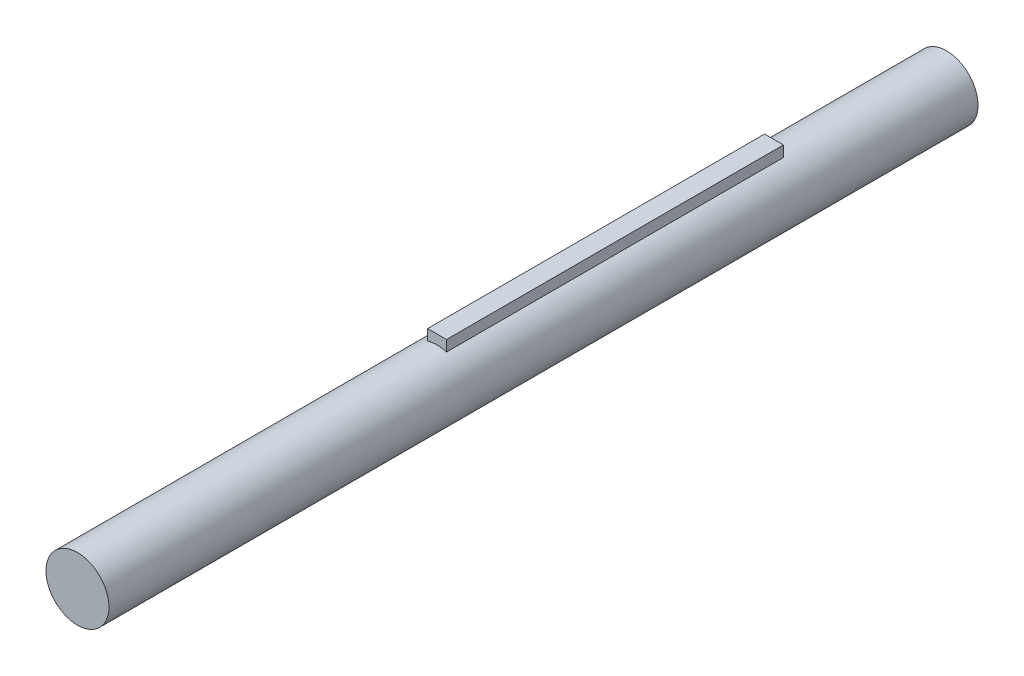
ISO-10303-21;
HEADER;
FILE_DESCRIPTION(('STEP AP214'),'2;1');
FILE_NAME('part.step','',(''),(''),'','','');
FILE_SCHEMA(('AUTOMOTIVE_DESIGN { 1 0 10303 214 1 1 1 1 }'));
ENDSEC;
DATA;
#1=APPLICATION_CONTEXT('core data for automotive mechanical design processes');
#2=APPLICATION_PROTOCOL_DEFINITION('international standard','automotive_design',2000,#1);
#3=PRODUCT_CONTEXT('',#1,'mechanical');
#4=PRODUCT('Part','Part','',(#3));
#5=PRODUCT_RELATED_PRODUCT_CATEGORY('part','',(#4));
#6=PRODUCT_DEFINITION_FORMATION('','',#4);
#7=PRODUCT_DEFINITION_CONTEXT('part definition',#1,'design');
#8=PRODUCT_DEFINITION('design','',#6,#7);
#9=PRODUCT_DEFINITION_SHAPE('','',#8);
#10=(LENGTH_UNIT() NAMED_UNIT(*) SI_UNIT(.MILLI.,.METRE.));
#11=(NAMED_UNIT(*) PLANE_ANGLE_UNIT() SI_UNIT($,.RADIAN.));
#12=(NAMED_UNIT(*) SI_UNIT($,.STERADIAN.) SOLID_ANGLE_UNIT());
#13=UNCERTAINTY_MEASURE_WITH_UNIT(LENGTH_MEASURE(1.E-05),#10,'distance_accuracy_value','');
#14=(GEOMETRIC_REPRESENTATION_CONTEXT(3) GLOBAL_UNCERTAINTY_ASSIGNED_CONTEXT((#13)) GLOBAL_UNIT_ASSIGNED_CONTEXT((#10,
#11,#12)) REPRESENTATION_CONTEXT('',''));
#15=CARTESIAN_POINT('',(0.,0.,0.));
#16=DIRECTION('',(0.,0.,1.));
#17=DIRECTION('',(1.,0.,0.));
#18=AXIS2_PLACEMENT_3D('',#15,#16,#17);
#19=CARTESIAN_POINT('',(0.,0.,0.));
#20=DIRECTION('',(0.,0.,1.));
#21=DIRECTION('',(1.,0.,0.));
#22=AXIS2_PLACEMENT_3D('',#19,#20,#21);
#23=PLANE('',#22);
#24=CARTESIAN_POINT('',(0.,0.,0.));
#25=DIRECTION('',(0.,0.,-1.));
#26=DIRECTION('',(-1.,0.,0.));
#27=AXIS2_PLACEMENT_3D('',#24,#25,#26);
#28=CIRCLE('',#27,12.7);
#29=CARTESIAN_POINT('',(-3.81,12.1150278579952,0.));
#30=VERTEX_POINT('',#29);
#31=CARTESIAN_POINT('',(3.81,12.1150278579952,0.));
#32=VERTEX_POINT('',#31);
#33=EDGE_CURVE('E74',#30,#32,#28,.T.);
#34=ORIENTED_EDGE('',*,*,#33,.F.);
#35=DIRECTION('',(0.,-1.,0.));
#36=VECTOR('',#35,1.);
#37=CARTESIAN_POINT('',(-3.81,16.51,0.));
#38=LINE('',#37,#36);
#39=CARTESIAN_POINT('',(-3.81,16.51,0.));
#40=VERTEX_POINT('',#39);
#41=EDGE_CURVE('E87',#40,#30,#38,.T.);
#42=ORIENTED_EDGE('',*,*,#41,.F.);
#43=DIRECTION('',(-1.,0.,0.));
#44=VECTOR('',#43,1.);
#45=CARTESIAN_POINT('',(3.81,16.51,0.));
#46=LINE('',#45,#44);
#47=CARTESIAN_POINT('',(3.81,16.51,0.));
#48=VERTEX_POINT('',#47);
#49=EDGE_CURVE('E67',#48,#40,#46,.T.);
#50=ORIENTED_EDGE('',*,*,#49,.F.);
#51=DIRECTION('',(0.,1.,0.));
#52=VECTOR('',#51,1.);
#53=CARTESIAN_POINT('',(3.81,16.51,0.));
#54=LINE('',#53,#52);
#55=EDGE_CURVE('E89',#32,#48,#54,.T.);
#56=ORIENTED_EDGE('',*,*,#55,.F.);
#57=EDGE_LOOP('',(#34,#42,#50,#56));
#58=FACE_BOUND('',#57,.T.);
#59=ADVANCED_FACE('F37',(#58),#23,.F.);
#60=CARTESIAN_POINT('',(3.81,16.51,135.89));
#61=DIRECTION('',(-1.,0.,0.));
#62=DIRECTION('',(0.,-1.,0.));
#63=AXIS2_PLACEMENT_3D('',#60,#61,#62);
#64=PLANE('',#63);
#65=ORIENTED_EDGE('',*,*,#55,.T.);
#66=DIRECTION('',(0.,0.,-1.));
#67=VECTOR('',#66,1.);
#68=CARTESIAN_POINT('',(3.81,16.51,135.89));
#69=LINE('',#68,#67);
#70=CARTESIAN_POINT('',(3.81,16.51,135.89));
#71=VERTEX_POINT('',#70);
#72=EDGE_CURVE('E11',#71,#48,#69,.T.);
#73=ORIENTED_EDGE('',*,*,#72,.F.);
#74=DIRECTION('',(0.,1.,0.));
#75=VECTOR('',#74,1.);
#76=CARTESIAN_POINT('',(3.81,16.51,135.89));
#77=LINE('',#76,#75);
#78=CARTESIAN_POINT('',(3.81,12.1150278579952,135.89));
#79=VERTEX_POINT('',#78);
#80=EDGE_CURVE('E96',#79,#71,#77,.T.);
#81=ORIENTED_EDGE('',*,*,#80,.F.);
#82=DIRECTION('',(0.,0.,-1.));
#83=VECTOR('',#82,1.);
#84=CARTESIAN_POINT('',(3.81,12.1150278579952,135.89));
#85=LINE('',#84,#83);
#86=EDGE_CURVE('E101',#79,#32,#85,.T.);
#87=ORIENTED_EDGE('',*,*,#86,.T.);
#88=EDGE_LOOP('',(#65,#73,#81,#87));
#89=FACE_BOUND('',#88,.T.);
#90=ADVANCED_FACE('F39',(#89),#64,.F.);
#91=CARTESIAN_POINT('',(3.81,16.51,135.89));
#92=DIRECTION('',(0.,-1.,0.));
#93=DIRECTION('',(1.,0.,0.));
#94=AXIS2_PLACEMENT_3D('',#91,#92,#93);
#95=PLANE('',#94);
#96=ORIENTED_EDGE('',*,*,#49,.T.);
#97=DIRECTION('',(0.,0.,-1.));
#98=VECTOR('',#97,1.);
#99=CARTESIAN_POINT('',(-3.81,16.51,135.89));
#100=LINE('',#99,#98);
#101=CARTESIAN_POINT('',(-3.81,16.51,135.89));
#102=VERTEX_POINT('',#101);
#103=EDGE_CURVE('E46',#102,#40,#100,.T.);
#104=ORIENTED_EDGE('',*,*,#103,.F.);
#105=DIRECTION('',(-1.,0.,0.));
#106=VECTOR('',#105,1.);
#107=CARTESIAN_POINT('',(3.81,16.51,135.89));
#108=LINE('',#107,#106);
#109=EDGE_CURVE('E77',#71,#102,#108,.T.);
#110=ORIENTED_EDGE('',*,*,#109,.F.);
#111=ORIENTED_EDGE('',*,*,#72,.T.);
#112=EDGE_LOOP('',(#96,#104,#110,#111));
#113=FACE_BOUND('',#112,.T.);
#114=ADVANCED_FACE('F128',(#113),#95,.F.);
#115=CARTESIAN_POINT('',(-3.81,16.51,135.89));
#116=DIRECTION('',(1.,0.,0.));
#117=DIRECTION('',(0.,1.,0.));
#118=AXIS2_PLACEMENT_3D('',#115,#116,#117);
#119=PLANE('',#118);
#120=ORIENTED_EDGE('',*,*,#41,.T.);
#121=DIRECTION('',(0.,0.,-1.));
#122=VECTOR('',#121,1.);
#123=CARTESIAN_POINT('',(-3.81,12.1150278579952,135.89));
#124=LINE('',#123,#122);
#125=CARTESIAN_POINT('',(-3.81,12.1150278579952,135.89));
#126=VERTEX_POINT('',#125);
#127=EDGE_CURVE('E94',#126,#30,#124,.T.);
#128=ORIENTED_EDGE('',*,*,#127,.F.);
#129=DIRECTION('',(0.,-1.,0.));
#130=VECTOR('',#129,1.);
#131=CARTESIAN_POINT('',(-3.81,16.51,135.89));
#132=LINE('',#131,#130);
#133=EDGE_CURVE('E54',#102,#126,#132,.T.);
#134=ORIENTED_EDGE('',*,*,#133,.F.);
#135=ORIENTED_EDGE('',*,*,#103,.T.);
#136=EDGE_LOOP('',(#120,#128,#134,#135));
#137=FACE_BOUND('',#136,.T.);
#138=ADVANCED_FACE('F93',(#137),#119,.F.);
#139=CARTESIAN_POINT('',(0.,0.,135.89));
#140=DIRECTION('',(0.,0.,-1.));
#141=DIRECTION('',(-1.,0.,0.));
#142=AXIS2_PLACEMENT_3D('',#139,#140,#141);
#143=CYLINDRICAL_SURFACE('',#142,12.7);
#144=ORIENTED_EDGE('',*,*,#127,.T.);
#145=ORIENTED_EDGE('',*,*,#33,.T.);
#146=ORIENTED_EDGE('',*,*,#86,.F.);
#147=CARTESIAN_POINT('',(0.,0.,135.89));
#148=DIRECTION('',(0.,0.,1.));
#149=DIRECTION('',(1.,0.,0.));
#150=AXIS2_PLACEMENT_3D('',#147,#148,#149);
#151=CIRCLE('',#150,12.7);
#152=EDGE_CURVE('E100',#79,#126,#151,.T.);
#153=ORIENTED_EDGE('',*,*,#152,.T.);
#154=EDGE_LOOP('',(#144,#145,#146,#153));
#155=FACE_BOUND('',#154,.T.);
#156=CARTESIAN_POINT('',(0.,0.,280.924));
#157=DIRECTION('',(0.,0.,1.));
#158=DIRECTION('',(1.,0.,0.));
#159=AXIS2_PLACEMENT_3D('',#156,#157,#158);
#160=CIRCLE('',#159,12.7);
#161=CARTESIAN_POINT('',(12.7,0.,280.924));
#162=VERTEX_POINT('',#161);
#163=EDGE_CURVE('E107',#162,#162,#160,.T.);
#164=ORIENTED_EDGE('',*,*,#163,.F.);
#165=EDGE_LOOP('',(#164));
#166=FACE_BOUND('',#165,.T.);
#167=CARTESIAN_POINT('',(0.,0.,-69.596));
#168=DIRECTION('',(0.,0.,-1.));
#169=DIRECTION('',(-1.,0.,0.));
#170=AXIS2_PLACEMENT_3D('',#167,#168,#169);
#171=CIRCLE('',#170,12.7);
#172=CARTESIAN_POINT('',(-12.7,0.,-69.596));
#173=VERTEX_POINT('',#172);
#174=EDGE_CURVE('E90',#173,#173,#171,.T.);
#175=ORIENTED_EDGE('',*,*,#174,.F.);
#176=EDGE_LOOP('',(#175));
#177=FACE_BOUND('',#176,.T.);
#178=ADVANCED_FACE('F98',(#155,#166,#177),#143,.T.);
#179=CARTESIAN_POINT('',(0.,0.,135.89));
#180=DIRECTION('',(0.,0.,1.));
#181=DIRECTION('',(1.,0.,0.));
#182=AXIS2_PLACEMENT_3D('',#179,#180,#181);
#183=PLANE('',#182);
#184=ORIENTED_EDGE('',*,*,#152,.F.);
#185=ORIENTED_EDGE('',*,*,#80,.T.);
#186=ORIENTED_EDGE('',*,*,#109,.T.);
#187=ORIENTED_EDGE('',*,*,#133,.T.);
#188=EDGE_LOOP('',(#184,#185,#186,#187));
#189=FACE_BOUND('',#188,.T.);
#190=ADVANCED_FACE('F120',(#189),#183,.T.);
#191=CARTESIAN_POINT('',(0.,0.,280.924));
#192=DIRECTION('',(0.,0.,1.));
#193=DIRECTION('',(1.,0.,0.));
#194=AXIS2_PLACEMENT_3D('',#191,#192,#193);
#195=PLANE('',#194);
#196=ORIENTED_EDGE('',*,*,#163,.T.);
#197=EDGE_LOOP('',(#196));
#198=FACE_BOUND('',#197,.T.);
#199=ADVANCED_FACE('F126',(#198),#195,.T.);
#200=CARTESIAN_POINT('',(0.,0.,-69.596));
#201=DIRECTION('',(0.,0.,-1.));
#202=DIRECTION('',(-1.,0.,0.));
#203=AXIS2_PLACEMENT_3D('',#200,#201,#202);
#204=PLANE('',#203);
#205=ORIENTED_EDGE('',*,*,#174,.T.);
#206=EDGE_LOOP('',(#205));
#207=FACE_BOUND('',#206,.T.);
#208=ADVANCED_FACE('F117',(#207),#204,.T.);
#209=CLOSED_SHELL('',(#59,#90,#114,#138,#178,#190,#199,#208));
#210=MANIFOLD_SOLID_BREP('B2',#209);
#211=ADVANCED_BREP_SHAPE_REPRESENTATION('',(#18,#210),#14);
#212=SHAPE_DEFINITION_REPRESENTATION(#9,#211);
ENDSEC;
END-ISO-10303-21;
